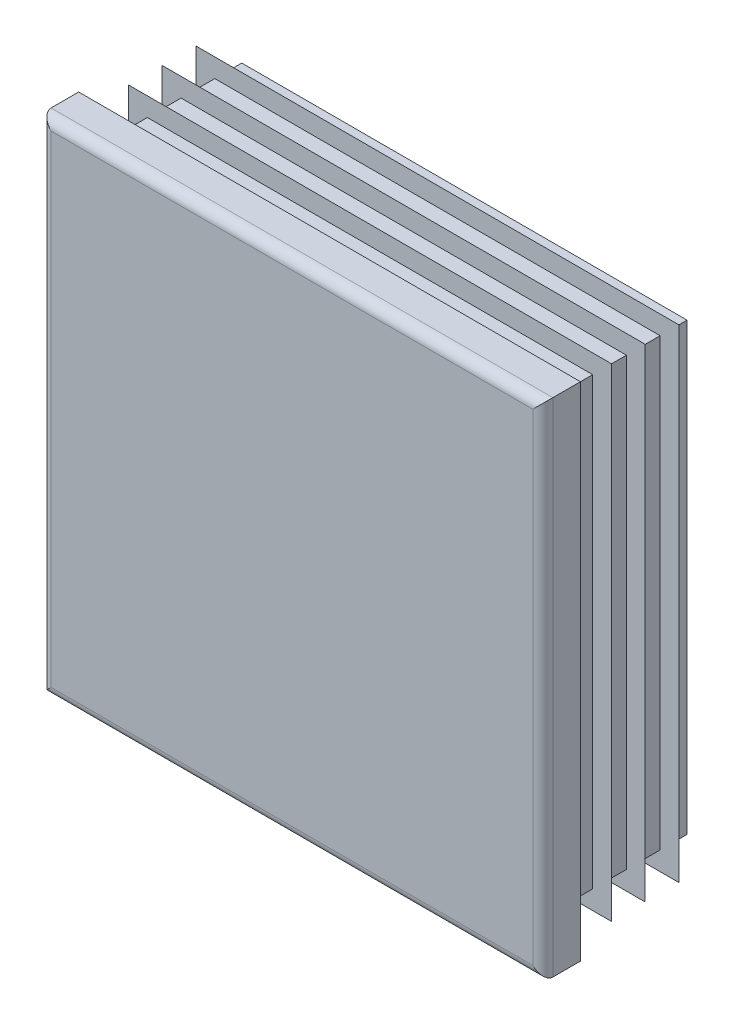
ISO-10303-21;
HEADER;
FILE_DESCRIPTION(('STEP AP214'),'2;1');
FILE_NAME('part.step','',(''),(''),'','','');
FILE_SCHEMA(('AUTOMOTIVE_DESIGN { 1 0 10303 214 1 1 1 1 }'));
ENDSEC;
DATA;
#1=APPLICATION_CONTEXT('core data for automotive mechanical design processes');
#2=APPLICATION_PROTOCOL_DEFINITION('international standard','automotive_design',2000,#1);
#3=PRODUCT_CONTEXT('',#1,'mechanical');
#4=PRODUCT('Part','Part','',(#3));
#5=PRODUCT_RELATED_PRODUCT_CATEGORY('part','',(#4));
#6=PRODUCT_DEFINITION_FORMATION('','',#4);
#7=PRODUCT_DEFINITION_CONTEXT('part definition',#1,'design');
#8=PRODUCT_DEFINITION('design','',#6,#7);
#9=PRODUCT_DEFINITION_SHAPE('','',#8);
#10=(LENGTH_UNIT() NAMED_UNIT(*) SI_UNIT(.MILLI.,.METRE.));
#11=(NAMED_UNIT(*) PLANE_ANGLE_UNIT() SI_UNIT($,.RADIAN.));
#12=(NAMED_UNIT(*) SI_UNIT($,.STERADIAN.) SOLID_ANGLE_UNIT());
#13=UNCERTAINTY_MEASURE_WITH_UNIT(LENGTH_MEASURE(1.E-05),#10,'distance_accuracy_value','');
#14=(GEOMETRIC_REPRESENTATION_CONTEXT(3) GLOBAL_UNCERTAINTY_ASSIGNED_CONTEXT((#13)) GLOBAL_UNIT_ASSIGNED_CONTEXT((#10,
#11,#12)) REPRESENTATION_CONTEXT('',''));
#15=CARTESIAN_POINT('',(0.,0.,0.));
#16=DIRECTION('',(0.,0.,1.));
#17=DIRECTION('',(1.,0.,0.));
#18=AXIS2_PLACEMENT_3D('',#15,#16,#17);
#19=CARTESIAN_POINT('',(38.4,-40.,6.));
#20=DIRECTION('',(0.,0.,-1.));
#21=DIRECTION('',(0.,1.,0.));
#22=AXIS2_PLACEMENT_3D('',#19,#20,#21);
#23=PLANE('',#22);
#24=DIRECTION('',(0.,1.,0.));
#25=VECTOR('',#24,1.);
#26=CARTESIAN_POINT('',(-38.4,-40.,6.));
#27=LINE('',#26,#25);
#28=CARTESIAN_POINT('',(-38.4,-38.4,6.));
#29=VERTEX_POINT('',#28);
#30=CARTESIAN_POINT('',(-38.4,38.4,6.));
#31=VERTEX_POINT('',#30);
#32=EDGE_CURVE('E262',#29,#31,#27,.T.);
#33=ORIENTED_EDGE('',*,*,#32,.F.);
#34=DIRECTION('',(-1.,0.,0.));
#35=VECTOR('',#34,1.);
#36=CARTESIAN_POINT('',(40.,-38.4,6.));
#37=LINE('',#36,#35);
#38=CARTESIAN_POINT('',(38.4,-38.4,6.));
#39=VERTEX_POINT('',#38);
#40=EDGE_CURVE('E432',#39,#29,#37,.T.);
#41=ORIENTED_EDGE('',*,*,#40,.F.);
#42=DIRECTION('',(0.,1.,0.));
#43=VECTOR('',#42,1.);
#44=CARTESIAN_POINT('',(38.4,-40.,6.));
#45=LINE('',#44,#43);
#46=CARTESIAN_POINT('',(38.4,38.4,6.));
#47=VERTEX_POINT('',#46);
#48=EDGE_CURVE('E257',#39,#47,#45,.T.);
#49=ORIENTED_EDGE('',*,*,#48,.T.);
#50=DIRECTION('',(-1.,0.,0.));
#51=VECTOR('',#50,1.);
#52=CARTESIAN_POINT('',(40.,38.4,6.));
#53=LINE('',#52,#51);
#54=EDGE_CURVE('E534',#47,#31,#53,.T.);
#55=ORIENTED_EDGE('',*,*,#54,.T.);
#56=EDGE_LOOP('',(#33,#41,#49,#55));
#57=FACE_BOUND('',#56,.T.);
#58=ADVANCED_FACE('F14',(#57),#23,.F.);
#59=CARTESIAN_POINT('',(-38.4,-40.,4.4));
#60=DIRECTION('',(0.,1.,0.));
#61=DIRECTION('',(-1.,0.,0.));
#62=AXIS2_PLACEMENT_3D('',#59,#60,#61);
#63=CYLINDRICAL_SURFACE('',#62,1.6);
#64=DIRECTION('',(0.,1.,0.));
#65=VECTOR('',#64,1.);
#66=CARTESIAN_POINT('',(-40.,-40.,4.4));
#67=LINE('',#66,#65);
#68=CARTESIAN_POINT('',(-40.,-40.,4.4));
#69=VERTEX_POINT('',#68);
#70=CARTESIAN_POINT('',(-40.,40.,4.4));
#71=VERTEX_POINT('',#70);
#72=EDGE_CURVE('E354',#69,#71,#67,.T.);
#73=ORIENTED_EDGE('',*,*,#72,.F.);
#74=CARTESIAN_POINT('',(-38.4,-38.4,4.4));
#75=DIRECTION('',(-0.707106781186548,0.707106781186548,0.));
#76=DIRECTION('',(0.707106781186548,0.707106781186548,0.));
#77=AXIS2_PLACEMENT_3D('',#74,#75,#76);
#78=ELLIPSE('',#77,2.26274169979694,1.6);
#79=EDGE_CURVE('E59',#69,#29,#78,.T.);
#80=ORIENTED_EDGE('',*,*,#79,.T.);
#81=ORIENTED_EDGE('',*,*,#32,.T.);
#82=CARTESIAN_POINT('',(-38.4,38.4,4.4));
#83=DIRECTION('',(0.707106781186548,0.707106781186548,0.));
#84=DIRECTION('',(-0.707106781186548,0.707106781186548,0.));
#85=AXIS2_PLACEMENT_3D('',#82,#83,#84);
#86=ELLIPSE('',#85,2.26274169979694,1.6);
#87=EDGE_CURVE('E258',#31,#71,#86,.F.);
#88=ORIENTED_EDGE('',*,*,#87,.T.);
#89=EDGE_LOOP('',(#73,#80,#81,#88));
#90=FACE_BOUND('',#89,.T.);
#91=ADVANCED_FACE('F16',(#90),#63,.T.);
#92=CARTESIAN_POINT('',(-40.,-40.,4.4));
#93=DIRECTION('',(1.,0.,0.));
#94=DIRECTION('',(0.,1.,0.));
#95=AXIS2_PLACEMENT_3D('',#92,#93,#94);
#96=PLANE('',#95);
#97=DIRECTION('',(0.,0.,-1.));
#98=VECTOR('',#97,1.);
#99=CARTESIAN_POINT('',(-40.,40.,4.4));
#100=LINE('',#99,#98);
#101=CARTESIAN_POINT('',(-40.,40.,0.));
#102=VERTEX_POINT('',#101);
#103=EDGE_CURVE('E519',#71,#102,#100,.T.);
#104=ORIENTED_EDGE('',*,*,#103,.T.);
#105=DIRECTION('',(0.,1.,0.));
#106=VECTOR('',#105,1.);
#107=CARTESIAN_POINT('',(-40.,-40.,0.));
#108=LINE('',#107,#106);
#109=CARTESIAN_POINT('',(-40.,-40.,0.));
#110=VERTEX_POINT('',#109);
#111=EDGE_CURVE('E352',#110,#102,#108,.T.);
#112=ORIENTED_EDGE('',*,*,#111,.F.);
#113=DIRECTION('',(0.,0.,-1.));
#114=VECTOR('',#113,1.);
#115=CARTESIAN_POINT('',(-40.,-40.,4.4));
#116=LINE('',#115,#114);
#117=EDGE_CURVE('E520',#69,#110,#116,.T.);
#118=ORIENTED_EDGE('',*,*,#117,.F.);
#119=ORIENTED_EDGE('',*,*,#72,.T.);
#120=EDGE_LOOP('',(#104,#112,#118,#119));
#121=FACE_BOUND('',#120,.T.);
#122=ADVANCED_FACE('F604',(#121),#96,.F.);
#123=CARTESIAN_POINT('',(-35.5,-40.,0.));
#124=DIRECTION('',(1.,0.,0.));
#125=DIRECTION('',(0.,1.,0.));
#126=AXIS2_PLACEMENT_3D('',#123,#124,#125);
#127=PLANE('',#126);
#128=DIRECTION('',(0.,1.,0.));
#129=VECTOR('',#128,1.);
#130=CARTESIAN_POINT('',(-35.5,-40.,0.));
#131=LINE('',#130,#129);
#132=CARTESIAN_POINT('',(-35.5,-35.5,0.));
#133=VERTEX_POINT('',#132);
#134=CARTESIAN_POINT('',(-35.5,35.5,0.));
#135=VERTEX_POINT('',#134);
#136=EDGE_CURVE('E349',#133,#135,#131,.T.);
#137=ORIENTED_EDGE('',*,*,#136,.T.);
#138=DIRECTION('',(0.,0.,-1.));
#139=VECTOR('',#138,1.);
#140=CARTESIAN_POINT('',(-35.5,35.5,0.));
#141=LINE('',#140,#139);
#142=CARTESIAN_POINT('',(-35.5,35.5,-1.075));
#143=VERTEX_POINT('',#142);
#144=EDGE_CURVE('E445',#135,#143,#141,.T.);
#145=ORIENTED_EDGE('',*,*,#144,.T.);
#146=DIRECTION('',(0.,1.,0.));
#147=VECTOR('',#146,1.);
#148=CARTESIAN_POINT('',(-35.5,-40.,-1.075));
#149=LINE('',#148,#147);
#150=CARTESIAN_POINT('',(-35.5,-35.5,-1.075));
#151=VERTEX_POINT('',#150);
#152=EDGE_CURVE('E346',#151,#143,#149,.T.);
#153=ORIENTED_EDGE('',*,*,#152,.F.);
#154=DIRECTION('',(0.,0.,1.));
#155=VECTOR('',#154,1.);
#156=CARTESIAN_POINT('',(-35.5,-35.5,0.));
#157=LINE('',#156,#155);
#158=EDGE_CURVE('E439',#151,#133,#157,.T.);
#159=ORIENTED_EDGE('',*,*,#158,.T.);
#160=EDGE_LOOP('',(#137,#145,#153,#159));
#161=FACE_BOUND('',#160,.T.);
#162=ADVANCED_FACE('F728',(#161),#127,.F.);
#163=CARTESIAN_POINT('',(-38.5,-40.,-1.075));
#164=DIRECTION('',(0.573576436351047,0.,0.819152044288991));
#165=DIRECTION('',(-0.819152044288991,0.,0.573576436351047));
#166=AXIS2_PLACEMENT_3D('',#163,#164,#165);
#167=PLANE('',#166);
#168=DIRECTION('',(0.,1.,0.));
#169=VECTOR('',#168,1.);
#170=CARTESIAN_POINT('',(-38.5,-40.,-1.075));
#171=LINE('',#170,#169);
#172=CARTESIAN_POINT('',(-38.5,-38.5,-1.075));
#173=VERTEX_POINT('',#172);
#174=CARTESIAN_POINT('',(-38.5,38.5,-1.075));
#175=VERTEX_POINT('',#174);
#176=EDGE_CURVE('E344',#173,#175,#171,.T.);
#177=ORIENTED_EDGE('',*,*,#176,.T.);
#178=DIRECTION('',(0.633687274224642,-0.633687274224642,-0.443712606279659));
#179=VECTOR('',#178,1.);
#180=CARTESIAN_POINT('',(-6.97757442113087,6.97757442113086,-23.1472400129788));
#181=LINE('',#180,#179);
#182=CARTESIAN_POINT('',(-35.5,35.5,-3.17562261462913));
#183=VERTEX_POINT('',#182);
#184=EDGE_CURVE('E457',#175,#183,#181,.T.);
#185=ORIENTED_EDGE('',*,*,#184,.T.);
#186=DIRECTION('',(0.,1.,0.));
#187=VECTOR('',#186,1.);
#188=CARTESIAN_POINT('',(-35.5,-40.,-3.17562261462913));
#189=LINE('',#188,#187);
#190=CARTESIAN_POINT('',(-35.5,-35.5,-3.17562261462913));
#191=VERTEX_POINT('',#190);
#192=EDGE_CURVE('E341',#191,#183,#189,.T.);
#193=ORIENTED_EDGE('',*,*,#192,.F.);
#194=DIRECTION('',(-0.633687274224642,-0.633687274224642,0.443712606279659));
#195=VECTOR('',#194,1.);
#196=CARTESIAN_POINT('',(-39.1023393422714,-39.1023393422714,-0.653237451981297));
#197=LINE('',#196,#195);
#198=EDGE_CURVE('E451',#191,#173,#197,.T.);
#199=ORIENTED_EDGE('',*,*,#198,.T.);
#200=EDGE_LOOP('',(#177,#185,#193,#199));
#201=FACE_BOUND('',#200,.T.);
#202=ADVANCED_FACE('F732',(#201),#167,.F.);
#203=CARTESIAN_POINT('',(-35.5,-40.,-3.17562261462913));
#204=DIRECTION('',(1.,0.,0.));
#205=DIRECTION('',(0.,1.,0.));
#206=AXIS2_PLACEMENT_3D('',#203,#204,#205);
#207=PLANE('',#206);
#208=ORIENTED_EDGE('',*,*,#192,.T.);
#209=DIRECTION('',(0.,0.,-1.));
#210=VECTOR('',#209,1.);
#211=CARTESIAN_POINT('',(-35.5,35.5,-3.17562261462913));
#212=LINE('',#211,#210);
#213=CARTESIAN_POINT('',(-35.5,35.5,-6.45));
#214=VERTEX_POINT('',#213);
#215=EDGE_CURVE('E463',#183,#214,#212,.T.);
#216=ORIENTED_EDGE('',*,*,#215,.T.);
#217=DIRECTION('',(0.,1.,0.));
#218=VECTOR('',#217,1.);
#219=CARTESIAN_POINT('',(-35.5,-40.,-6.45));
#220=LINE('',#219,#218);
#221=CARTESIAN_POINT('',(-35.5,-35.5,-6.45));
#222=VERTEX_POINT('',#221);
#223=EDGE_CURVE('E338',#222,#214,#220,.T.);
#224=ORIENTED_EDGE('',*,*,#223,.F.);
#225=DIRECTION('',(0.,0.,1.));
#226=VECTOR('',#225,1.);
#227=CARTESIAN_POINT('',(-35.5,-35.5,-3.17562261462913));
#228=LINE('',#227,#226);
#229=EDGE_CURVE('E460',#222,#191,#228,.T.);
#230=ORIENTED_EDGE('',*,*,#229,.T.);
#231=EDGE_LOOP('',(#208,#216,#224,#230));
#232=FACE_BOUND('',#231,.T.);
#233=ADVANCED_FACE('F738',(#232),#207,.F.);
#234=CARTESIAN_POINT('',(-38.5,-40.,-6.45));
#235=DIRECTION('',(0.573576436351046,0.,0.819152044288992));
#236=DIRECTION('',(-0.819152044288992,0.,0.573576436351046));
#237=AXIS2_PLACEMENT_3D('',#234,#235,#236);
#238=PLANE('',#237);
#239=DIRECTION('',(0.,1.,0.));
#240=VECTOR('',#239,1.);
#241=CARTESIAN_POINT('',(-38.5,-40.,-6.45));
#242=LINE('',#241,#240);
#243=CARTESIAN_POINT('',(-38.5,-38.5,-6.45));
#244=VERTEX_POINT('',#243);
#245=CARTESIAN_POINT('',(-38.5,38.5,-6.45));
#246=VERTEX_POINT('',#245);
#247=EDGE_CURVE('E336',#244,#246,#242,.T.);
#248=ORIENTED_EDGE('',*,*,#247,.T.);
#249=DIRECTION('',(0.633687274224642,-0.633687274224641,-0.443712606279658));
#250=VECTOR('',#249,1.);
#251=CARTESIAN_POINT('',(-6.97757442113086,6.97757442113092,-28.5222400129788));
#252=LINE('',#251,#250);
#253=CARTESIAN_POINT('',(-35.5,35.5,-8.55062261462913));
#254=VERTEX_POINT('',#253);
#255=EDGE_CURVE('E475',#246,#254,#252,.T.);
#256=ORIENTED_EDGE('',*,*,#255,.T.);
#257=DIRECTION('',(0.,1.,0.));
#258=VECTOR('',#257,1.);
#259=CARTESIAN_POINT('',(-35.5,-40.,-8.55062261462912));
#260=LINE('',#259,#258);
#261=CARTESIAN_POINT('',(-35.5,-35.5,-8.55062261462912));
#262=VERTEX_POINT('',#261);
#263=EDGE_CURVE('E333',#262,#254,#260,.T.);
#264=ORIENTED_EDGE('',*,*,#263,.F.);
#265=DIRECTION('',(-0.633687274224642,-0.633687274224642,0.443712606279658));
#266=VECTOR('',#265,1.);
#267=CARTESIAN_POINT('',(-39.1023393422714,-39.1023393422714,-6.0282374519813));
#268=LINE('',#267,#266);
#269=EDGE_CURVE('E469',#262,#244,#268,.T.);
#270=ORIENTED_EDGE('',*,*,#269,.T.);
#271=EDGE_LOOP('',(#248,#256,#264,#270));
#272=FACE_BOUND('',#271,.T.);
#273=ADVANCED_FACE('F742',(#272),#238,.F.);
#274=CARTESIAN_POINT('',(-35.5,-40.,-8.55062261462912));
#275=DIRECTION('',(1.,0.,0.));
#276=DIRECTION('',(0.,1.,0.));
#277=AXIS2_PLACEMENT_3D('',#274,#275,#276);
#278=PLANE('',#277);
#279=ORIENTED_EDGE('',*,*,#263,.T.);
#280=DIRECTION('',(0.,0.,-1.));
#281=VECTOR('',#280,1.);
#282=CARTESIAN_POINT('',(-35.5,35.5,-8.55062261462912));
#283=LINE('',#282,#281);
#284=CARTESIAN_POINT('',(-35.5,35.5,-11.825));
#285=VERTEX_POINT('',#284);
#286=EDGE_CURVE('E481',#254,#285,#283,.T.);
#287=ORIENTED_EDGE('',*,*,#286,.T.);
#288=DIRECTION('',(0.,1.,0.));
#289=VECTOR('',#288,1.);
#290=CARTESIAN_POINT('',(-35.5,-40.,-11.825));
#291=LINE('',#290,#289);
#292=CARTESIAN_POINT('',(-35.5,-35.5,-11.825));
#293=VERTEX_POINT('',#292);
#294=EDGE_CURVE('E330',#293,#285,#291,.T.);
#295=ORIENTED_EDGE('',*,*,#294,.F.);
#296=DIRECTION('',(0.,0.,1.));
#297=VECTOR('',#296,1.);
#298=CARTESIAN_POINT('',(-35.5,-35.5,-8.55062261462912));
#299=LINE('',#298,#297);
#300=EDGE_CURVE('E478',#293,#262,#299,.T.);
#301=ORIENTED_EDGE('',*,*,#300,.T.);
#302=EDGE_LOOP('',(#279,#287,#295,#301));
#303=FACE_BOUND('',#302,.T.);
#304=ADVANCED_FACE('F746',(#303),#278,.F.);
#305=CARTESIAN_POINT('',(-38.5,-40.,-11.825));
#306=DIRECTION('',(0.573576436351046,0.,0.819152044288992));
#307=DIRECTION('',(-0.819152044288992,0.,0.573576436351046));
#308=AXIS2_PLACEMENT_3D('',#305,#306,#307);
#309=PLANE('',#308);
#310=DIRECTION('',(0.,1.,0.));
#311=VECTOR('',#310,1.);
#312=CARTESIAN_POINT('',(-38.5,-40.,-11.825));
#313=LINE('',#312,#311);
#314=CARTESIAN_POINT('',(-38.5,-38.5,-11.825));
#315=VERTEX_POINT('',#314);
#316=CARTESIAN_POINT('',(-38.5,38.5,-11.825));
#317=VERTEX_POINT('',#316);
#318=EDGE_CURVE('E328',#315,#317,#313,.T.);
#319=ORIENTED_EDGE('',*,*,#318,.T.);
#320=DIRECTION('',(0.633687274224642,-0.633687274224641,-0.443712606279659));
#321=VECTOR('',#320,1.);
#322=CARTESIAN_POINT('',(-6.97757442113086,6.97757442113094,-33.8972400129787));
#323=LINE('',#322,#321);
#324=CARTESIAN_POINT('',(-35.5,35.5,-13.9256226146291));
#325=VERTEX_POINT('',#324);
#326=EDGE_CURVE('E493',#317,#325,#323,.T.);
#327=ORIENTED_EDGE('',*,*,#326,.T.);
#328=DIRECTION('',(0.,1.,0.));
#329=VECTOR('',#328,1.);
#330=CARTESIAN_POINT('',(-35.5,-40.,-13.9256226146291));
#331=LINE('',#330,#329);
#332=CARTESIAN_POINT('',(-35.5,-35.5,-13.9256226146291));
#333=VERTEX_POINT('',#332);
#334=EDGE_CURVE('E325',#333,#325,#331,.T.);
#335=ORIENTED_EDGE('',*,*,#334,.F.);
#336=DIRECTION('',(-0.633687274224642,-0.633687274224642,0.443712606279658));
#337=VECTOR('',#336,1.);
#338=CARTESIAN_POINT('',(-39.1023393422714,-39.1023393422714,-11.4032374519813));
#339=LINE('',#338,#337);
#340=EDGE_CURVE('E487',#333,#315,#339,.T.);
#341=ORIENTED_EDGE('',*,*,#340,.T.);
#342=EDGE_LOOP('',(#319,#327,#335,#341));
#343=FACE_BOUND('',#342,.T.);
#344=ADVANCED_FACE('F668',(#343),#309,.F.);
#345=CARTESIAN_POINT('',(-35.5,-40.,-13.9256226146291));
#346=DIRECTION('',(1.,0.,0.));
#347=DIRECTION('',(0.,1.,0.));
#348=AXIS2_PLACEMENT_3D('',#345,#346,#347);
#349=PLANE('',#348);
#350=ORIENTED_EDGE('',*,*,#334,.T.);
#351=DIRECTION('',(0.,0.,-1.));
#352=VECTOR('',#351,1.);
#353=CARTESIAN_POINT('',(-35.5,35.5,-13.9256226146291));
#354=LINE('',#353,#352);
#355=CARTESIAN_POINT('',(-35.5,35.5,-17.2));
#356=VERTEX_POINT('',#355);
#357=EDGE_CURVE('E499',#325,#356,#354,.T.);
#358=ORIENTED_EDGE('',*,*,#357,.T.);
#359=DIRECTION('',(0.,1.,0.));
#360=VECTOR('',#359,1.);
#361=CARTESIAN_POINT('',(-35.5,-40.,-17.2));
#362=LINE('',#361,#360);
#363=CARTESIAN_POINT('',(-35.5,-35.5,-17.2));
#364=VERTEX_POINT('',#363);
#365=EDGE_CURVE('E322',#364,#356,#362,.T.);
#366=ORIENTED_EDGE('',*,*,#365,.F.);
#367=DIRECTION('',(0.,0.,1.));
#368=VECTOR('',#367,1.);
#369=CARTESIAN_POINT('',(-35.5,-35.5,-13.9256226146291));
#370=LINE('',#369,#368);
#371=EDGE_CURVE('E496',#364,#333,#370,.T.);
#372=ORIENTED_EDGE('',*,*,#371,.T.);
#373=EDGE_LOOP('',(#350,#358,#366,#372));
#374=FACE_BOUND('',#373,.T.);
#375=ADVANCED_FACE('F665',(#374),#349,.F.);
#376=CARTESIAN_POINT('',(-38.5,-40.,-17.2));
#377=DIRECTION('',(0.573576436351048,0.,0.819152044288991));
#378=DIRECTION('',(-0.819152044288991,0.,0.573576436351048));
#379=AXIS2_PLACEMENT_3D('',#376,#377,#378);
#380=PLANE('',#379);
#381=DIRECTION('',(0.,1.,0.));
#382=VECTOR('',#381,1.);
#383=CARTESIAN_POINT('',(-38.5,-40.,-17.2));
#384=LINE('',#383,#382);
#385=CARTESIAN_POINT('',(-38.5,-38.5,-17.2));
#386=VERTEX_POINT('',#385);
#387=CARTESIAN_POINT('',(-38.5,38.5,-17.2));
#388=VERTEX_POINT('',#387);
#389=EDGE_CURVE('E320',#386,#388,#384,.T.);
#390=ORIENTED_EDGE('',*,*,#389,.T.);
#391=DIRECTION('',(0.633687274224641,-0.633687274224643,-0.443712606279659));
#392=VECTOR('',#391,1.);
#393=CARTESIAN_POINT('',(-6.97757442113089,6.97757442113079,-39.2722400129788));
#394=LINE('',#393,#392);
#395=CARTESIAN_POINT('',(-35.5,35.5,-19.3006226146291));
#396=VERTEX_POINT('',#395);
#397=EDGE_CURVE('E511',#388,#396,#394,.T.);
#398=ORIENTED_EDGE('',*,*,#397,.T.);
#399=DIRECTION('',(0.,1.,0.));
#400=VECTOR('',#399,1.);
#401=CARTESIAN_POINT('',(-35.5,-40.,-19.3006226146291));
#402=LINE('',#401,#400);
#403=CARTESIAN_POINT('',(-35.5,-35.5,-19.3006226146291));
#404=VERTEX_POINT('',#403);
#405=EDGE_CURVE('E317',#404,#396,#402,.T.);
#406=ORIENTED_EDGE('',*,*,#405,.F.);
#407=DIRECTION('',(-0.633687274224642,-0.633687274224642,0.44371260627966));
#408=VECTOR('',#407,1.);
#409=CARTESIAN_POINT('',(-39.1023393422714,-39.1023393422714,-16.7782374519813));
#410=LINE('',#409,#408);
#411=EDGE_CURVE('E505',#404,#386,#410,.T.);
#412=ORIENTED_EDGE('',*,*,#411,.T.);
#413=EDGE_LOOP('',(#390,#398,#406,#412));
#414=FACE_BOUND('',#413,.T.);
#415=ADVANCED_FACE('F580',(#414),#380,.F.);
#416=CARTESIAN_POINT('',(-35.5,-40.,-19.3006226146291));
#417=DIRECTION('',(1.,0.,0.));
#418=DIRECTION('',(0.,1.,0.));
#419=AXIS2_PLACEMENT_3D('',#416,#417,#418);
#420=PLANE('',#419);
#421=ORIENTED_EDGE('',*,*,#405,.T.);
#422=DIRECTION('',(0.,0.,-1.));
#423=VECTOR('',#422,1.);
#424=CARTESIAN_POINT('',(-35.5,35.5,-19.3006226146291));
#425=LINE('',#424,#423);
#426=CARTESIAN_POINT('',(-35.5,35.5,-21.5));
#427=VERTEX_POINT('',#426);
#428=EDGE_CURVE('E517',#396,#427,#425,.T.);
#429=ORIENTED_EDGE('',*,*,#428,.T.);
#430=DIRECTION('',(0.,1.,0.));
#431=VECTOR('',#430,1.);
#432=CARTESIAN_POINT('',(-35.5,-40.,-21.5));
#433=LINE('',#432,#431);
#434=CARTESIAN_POINT('',(-35.5,-35.5,-21.5));
#435=VERTEX_POINT('',#434);
#436=EDGE_CURVE('E314',#435,#427,#433,.T.);
#437=ORIENTED_EDGE('',*,*,#436,.F.);
#438=DIRECTION('',(0.,0.,1.));
#439=VECTOR('',#438,1.);
#440=CARTESIAN_POINT('',(-35.5,-35.5,-19.3006226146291));
#441=LINE('',#440,#439);
#442=EDGE_CURVE('E514',#435,#404,#441,.T.);
#443=ORIENTED_EDGE('',*,*,#442,.T.);
#444=EDGE_LOOP('',(#421,#429,#437,#443));
#445=FACE_BOUND('',#444,.T.);
#446=ADVANCED_FACE('F582',(#445),#420,.F.);
#447=CARTESIAN_POINT('',(-35.5,-40.,-21.5));
#448=DIRECTION('',(0.,0.,1.));
#449=DIRECTION('',(0.,-1.,0.));
#450=AXIS2_PLACEMENT_3D('',#447,#448,#449);
#451=PLANE('',#450);
#452=ORIENTED_EDGE('',*,*,#436,.T.);
#453=DIRECTION('',(-1.,0.,0.));
#454=VECTOR('',#453,1.);
#455=CARTESIAN_POINT('',(40.,35.5,-21.5));
#456=LINE('',#455,#454);
#457=CARTESIAN_POINT('',(35.5,35.5,-21.5));
#458=VERTEX_POINT('',#457);
#459=EDGE_CURVE('E388',#458,#427,#456,.T.);
#460=ORIENTED_EDGE('',*,*,#459,.F.);
#461=DIRECTION('',(0.,1.,0.));
#462=VECTOR('',#461,1.);
#463=CARTESIAN_POINT('',(35.5,-40.,-21.5));
#464=LINE('',#463,#462);
#465=CARTESIAN_POINT('',(35.5,-35.5,-21.5));
#466=VERTEX_POINT('',#465);
#467=EDGE_CURVE('E311',#466,#458,#464,.T.);
#468=ORIENTED_EDGE('',*,*,#467,.F.);
#469=DIRECTION('',(-1.,0.,0.));
#470=VECTOR('',#469,1.);
#471=CARTESIAN_POINT('',(40.,-35.5,-21.5));
#472=LINE('',#471,#470);
#473=EDGE_CURVE('E386',#466,#435,#472,.T.);
#474=ORIENTED_EDGE('',*,*,#473,.T.);
#475=EDGE_LOOP('',(#452,#460,#468,#474));
#476=FACE_BOUND('',#475,.T.);
#477=ADVANCED_FACE('F385',(#476),#451,.F.);
#478=CARTESIAN_POINT('',(35.5,-40.,-21.5));
#479=DIRECTION('',(-1.,0.,0.));
#480=DIRECTION('',(0.,-1.,0.));
#481=AXIS2_PLACEMENT_3D('',#478,#479,#480);
#482=PLANE('',#481);
#483=ORIENTED_EDGE('',*,*,#467,.T.);
#484=DIRECTION('',(0.,0.,1.));
#485=VECTOR('',#484,1.);
#486=CARTESIAN_POINT('',(35.5,35.5,-21.5));
#487=LINE('',#486,#485);
#488=CARTESIAN_POINT('',(35.5,35.5,-19.3006226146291));
#489=VERTEX_POINT('',#488);
#490=EDGE_CURVE('E9',#458,#489,#487,.T.);
#491=ORIENTED_EDGE('',*,*,#490,.T.);
#492=DIRECTION('',(0.,1.,0.));
#493=VECTOR('',#492,1.);
#494=CARTESIAN_POINT('',(35.5,-40.,-19.3006226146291));
#495=LINE('',#494,#493);
#496=CARTESIAN_POINT('',(35.5,-35.5,-19.3006226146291));
#497=VERTEX_POINT('',#496);
#498=EDGE_CURVE('E308',#497,#489,#495,.T.);
#499=ORIENTED_EDGE('',*,*,#498,.F.);
#500=DIRECTION('',(0.,0.,-1.));
#501=VECTOR('',#500,1.);
#502=CARTESIAN_POINT('',(35.5,-35.5,-21.5));
#503=LINE('',#502,#501);
#504=EDGE_CURVE('E23',#497,#466,#503,.T.);
#505=ORIENTED_EDGE('',*,*,#504,.T.);
#506=EDGE_LOOP('',(#483,#491,#499,#505));
#507=FACE_BOUND('',#506,.T.);
#508=ADVANCED_FACE('F378',(#507),#482,.F.);
#509=CARTESIAN_POINT('',(35.5,-40.,-19.3006226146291));
#510=DIRECTION('',(-0.573576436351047,0.,0.819152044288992));
#511=DIRECTION('',(-0.819152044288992,0.,-0.573576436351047));
#512=AXIS2_PLACEMENT_3D('',#509,#510,#511);
#513=PLANE('',#512);
#514=ORIENTED_EDGE('',*,*,#498,.T.);
#515=DIRECTION('',(0.633687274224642,0.633687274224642,0.443712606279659));
#516=VECTOR('',#515,1.);
#517=CARTESIAN_POINT('',(5.18225310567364,5.18225310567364,-40.5293375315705));
#518=LINE('',#517,#516);
#519=CARTESIAN_POINT('',(38.5,38.5,-17.2));
#520=VERTEX_POINT('',#519);
#521=EDGE_CURVE('E508',#489,#520,#518,.T.);
#522=ORIENTED_EDGE('',*,*,#521,.T.);
#523=DIRECTION('',(0.,1.,0.));
#524=VECTOR('',#523,1.);
#525=CARTESIAN_POINT('',(38.5,-40.,-17.2));
#526=LINE('',#525,#524);
#527=CARTESIAN_POINT('',(38.5,-38.5,-17.2));
#528=VERTEX_POINT('',#527);
#529=EDGE_CURVE('E305',#528,#520,#526,.T.);
#530=ORIENTED_EDGE('',*,*,#529,.F.);
#531=DIRECTION('',(-0.633687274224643,0.633687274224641,-0.443712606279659));
#532=VECTOR('',#531,1.);
#533=CARTESIAN_POINT('',(37.3070180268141,-37.3070180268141,-18.0353349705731));
#534=LINE('',#533,#532);
#535=EDGE_CURVE('E502',#528,#497,#534,.T.);
#536=ORIENTED_EDGE('',*,*,#535,.T.);
#537=EDGE_LOOP('',(#514,#522,#530,#536));
#538=FACE_BOUND('',#537,.T.);
#539=ADVANCED_FACE('F588',(#538),#513,.F.);
#540=CARTESIAN_POINT('',(38.5,-40.,-17.2));
#541=DIRECTION('',(0.,0.,-1.));
#542=DIRECTION('',(0.,1.,0.));
#543=AXIS2_PLACEMENT_3D('',#540,#541,#542);
#544=PLANE('',#543);
#545=ORIENTED_EDGE('',*,*,#529,.T.);
#546=DIRECTION('',(-1.,0.,0.));
#547=VECTOR('',#546,1.);
#548=CARTESIAN_POINT('',(40.,38.5,-17.2));
#549=LINE('',#548,#547);
#550=EDGE_CURVE('E394',#520,#388,#549,.T.);
#551=ORIENTED_EDGE('',*,*,#550,.T.);
#552=ORIENTED_EDGE('',*,*,#389,.F.);
#553=DIRECTION('',(-1.,0.,0.));
#554=VECTOR('',#553,1.);
#555=CARTESIAN_POINT('',(40.,-38.5,-17.2));
#556=LINE('',#555,#554);
#557=EDGE_CURVE('E401',#528,#386,#556,.T.);
#558=ORIENTED_EDGE('',*,*,#557,.F.);
#559=EDGE_LOOP('',(#545,#551,#552,#558));
#560=FACE_BOUND('',#559,.T.);
#561=ORIENTED_EDGE('',*,*,#365,.T.);
#562=DIRECTION('',(-1.,0.,0.));
#563=VECTOR('',#562,1.);
#564=CARTESIAN_POINT('',(40.,35.5,-17.2));
#565=LINE('',#564,#563);
#566=CARTESIAN_POINT('',(35.5,35.5,-17.2));
#567=VERTEX_POINT('',#566);
#568=EDGE_CURVE('E567',#567,#356,#565,.T.);
#569=ORIENTED_EDGE('',*,*,#568,.F.);
#570=DIRECTION('',(0.,1.,0.));
#571=VECTOR('',#570,1.);
#572=CARTESIAN_POINT('',(35.5,-40.,-17.2));
#573=LINE('',#572,#571);
#574=CARTESIAN_POINT('',(35.5,-35.5,-17.2));
#575=VERTEX_POINT('',#574);
#576=EDGE_CURVE('E302',#575,#567,#573,.T.);
#577=ORIENTED_EDGE('',*,*,#576,.F.);
#578=DIRECTION('',(-1.,0.,0.));
#579=VECTOR('',#578,1.);
#580=CARTESIAN_POINT('',(40.,-35.5,-17.2));
#581=LINE('',#580,#579);
#582=EDGE_CURVE('E403',#575,#364,#581,.T.);
#583=ORIENTED_EDGE('',*,*,#582,.T.);
#584=EDGE_LOOP('',(#561,#569,#577,#583));
#585=FACE_BOUND('',#584,.T.);
#586=ADVANCED_FACE('F571',(#560,#585),#544,.F.);
#587=CARTESIAN_POINT('',(35.5,-40.,-17.2));
#588=DIRECTION('',(-1.,0.,0.));
#589=DIRECTION('',(0.,-1.,0.));
#590=AXIS2_PLACEMENT_3D('',#587,#588,#589);
#591=PLANE('',#590);
#592=ORIENTED_EDGE('',*,*,#576,.T.);
#593=DIRECTION('',(0.,0.,1.));
#594=VECTOR('',#593,1.);
#595=CARTESIAN_POINT('',(35.5,35.5,-17.2));
#596=LINE('',#595,#594);
#597=CARTESIAN_POINT('',(35.5,35.5,-13.9256226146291));
#598=VERTEX_POINT('',#597);
#599=EDGE_CURVE('E372',#567,#598,#596,.T.);
#600=ORIENTED_EDGE('',*,*,#599,.T.);
#601=DIRECTION('',(0.,1.,0.));
#602=VECTOR('',#601,1.);
#603=CARTESIAN_POINT('',(35.5,-40.,-13.9256226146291));
#604=LINE('',#603,#602);
#605=CARTESIAN_POINT('',(35.5,-35.5,-13.9256226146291));
#606=VERTEX_POINT('',#605);
#607=EDGE_CURVE('E299',#606,#598,#604,.T.);
#608=ORIENTED_EDGE('',*,*,#607,.F.);
#609=DIRECTION('',(0.,0.,-1.));
#610=VECTOR('',#609,1.);
#611=CARTESIAN_POINT('',(35.5,-35.5,-17.2));
#612=LINE('',#611,#610);
#613=EDGE_CURVE('E369',#606,#575,#612,.T.);
#614=ORIENTED_EDGE('',*,*,#613,.T.);
#615=EDGE_LOOP('',(#592,#600,#608,#614));
#616=FACE_BOUND('',#615,.T.);
#617=ADVANCED_FACE('F596',(#616),#591,.F.);
#618=CARTESIAN_POINT('',(35.5,-40.,-13.9256226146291));
#619=DIRECTION('',(-0.573576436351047,0.,0.819152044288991));
#620=DIRECTION('',(-0.819152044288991,0.,-0.573576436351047));
#621=AXIS2_PLACEMENT_3D('',#618,#619,#620);
#622=PLANE('',#621);
#623=ORIENTED_EDGE('',*,*,#607,.T.);
#624=DIRECTION('',(0.633687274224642,0.633687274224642,0.443712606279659));
#625=VECTOR('',#624,1.);
#626=CARTESIAN_POINT('',(5.18225310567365,5.18225310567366,-35.1543375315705));
#627=LINE('',#626,#625);
#628=CARTESIAN_POINT('',(38.5,38.5,-11.825));
#629=VERTEX_POINT('',#628);
#630=EDGE_CURVE('E490',#598,#629,#627,.T.);
#631=ORIENTED_EDGE('',*,*,#630,.T.);
#632=DIRECTION('',(0.,1.,0.));
#633=VECTOR('',#632,1.);
#634=CARTESIAN_POINT('',(38.5,-40.,-11.825));
#635=LINE('',#634,#633);
#636=CARTESIAN_POINT('',(38.5,-38.5,-11.825));
#637=VERTEX_POINT('',#636);
#638=EDGE_CURVE('E296',#637,#629,#635,.T.);
#639=ORIENTED_EDGE('',*,*,#638,.F.);
#640=DIRECTION('',(-0.633687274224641,0.633687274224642,-0.443712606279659));
#641=VECTOR('',#640,1.);
#642=CARTESIAN_POINT('',(37.3070180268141,-37.3070180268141,-12.660334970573));
#643=LINE('',#642,#641);
#644=EDGE_CURVE('E484',#637,#606,#643,.T.);
#645=ORIENTED_EDGE('',*,*,#644,.T.);
#646=EDGE_LOOP('',(#623,#631,#639,#645));
#647=FACE_BOUND('',#646,.T.);
#648=ADVANCED_FACE('F648',(#647),#622,.F.);
#649=CARTESIAN_POINT('',(38.5,-40.,-11.825));
#650=DIRECTION('',(0.,0.,-1.));
#651=DIRECTION('',(0.,1.,0.));
#652=AXIS2_PLACEMENT_3D('',#649,#650,#651);
#653=PLANE('',#652);
#654=ORIENTED_EDGE('',*,*,#638,.T.);
#655=DIRECTION('',(-1.,0.,0.));
#656=VECTOR('',#655,1.);
#657=CARTESIAN_POINT('',(40.,38.5,-11.825));
#658=LINE('',#657,#656);
#659=EDGE_CURVE('E561',#629,#317,#658,.T.);
#660=ORIENTED_EDGE('',*,*,#659,.T.);
#661=ORIENTED_EDGE('',*,*,#318,.F.);
#662=DIRECTION('',(-1.,0.,0.));
#663=VECTOR('',#662,1.);
#664=CARTESIAN_POINT('',(40.,-38.5,-11.825));
#665=LINE('',#664,#663);
#666=EDGE_CURVE('E409',#637,#315,#665,.T.);
#667=ORIENTED_EDGE('',*,*,#666,.F.);
#668=EDGE_LOOP('',(#654,#660,#661,#667));
#669=FACE_BOUND('',#668,.T.);
#670=ORIENTED_EDGE('',*,*,#294,.T.);
#671=DIRECTION('',(-1.,0.,0.));
#672=VECTOR('',#671,1.);
#673=CARTESIAN_POINT('',(40.,35.5,-11.825));
#674=LINE('',#673,#672);
#675=CARTESIAN_POINT('',(35.5,35.5,-11.825));
#676=VERTEX_POINT('',#675);
#677=EDGE_CURVE('E559',#676,#285,#674,.T.);
#678=ORIENTED_EDGE('',*,*,#677,.F.);
#679=DIRECTION('',(0.,1.,0.));
#680=VECTOR('',#679,1.);
#681=CARTESIAN_POINT('',(35.5,-40.,-11.825));
#682=LINE('',#681,#680);
#683=CARTESIAN_POINT('',(35.5,-35.5,-11.825));
#684=VERTEX_POINT('',#683);
#685=EDGE_CURVE('E293',#684,#676,#682,.T.);
#686=ORIENTED_EDGE('',*,*,#685,.F.);
#687=DIRECTION('',(-1.,0.,0.));
#688=VECTOR('',#687,1.);
#689=CARTESIAN_POINT('',(40.,-35.5,-11.825));
#690=LINE('',#689,#688);
#691=EDGE_CURVE('E411',#684,#293,#690,.T.);
#692=ORIENTED_EDGE('',*,*,#691,.T.);
#693=EDGE_LOOP('',(#670,#678,#686,#692));
#694=FACE_BOUND('',#693,.T.);
#695=ADVANCED_FACE('F644',(#669,#694),#653,.F.);
#696=CARTESIAN_POINT('',(35.5,-40.,-11.825));
#697=DIRECTION('',(-1.,0.,0.));
#698=DIRECTION('',(0.,-1.,0.));
#699=AXIS2_PLACEMENT_3D('',#696,#697,#698);
#700=PLANE('',#699);
#701=ORIENTED_EDGE('',*,*,#685,.T.);
#702=DIRECTION('',(0.,0.,1.));
#703=VECTOR('',#702,1.);
#704=CARTESIAN_POINT('',(35.5,35.5,-11.825));
#705=LINE('',#704,#703);
#706=CARTESIAN_POINT('',(35.5,35.5,-8.55062261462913));
#707=VERTEX_POINT('',#706);
#708=EDGE_CURVE('E366',#676,#707,#705,.T.);
#709=ORIENTED_EDGE('',*,*,#708,.T.);
#710=DIRECTION('',(0.,1.,0.));
#711=VECTOR('',#710,1.);
#712=CARTESIAN_POINT('',(35.5,-40.,-8.55062261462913));
#713=LINE('',#712,#711);
#714=CARTESIAN_POINT('',(35.5,-35.5,-8.55062261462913));
#715=VERTEX_POINT('',#714);
#716=EDGE_CURVE('E290',#715,#707,#713,.T.);
#717=ORIENTED_EDGE('',*,*,#716,.F.);
#718=DIRECTION('',(0.,0.,-1.));
#719=VECTOR('',#718,1.);
#720=CARTESIAN_POINT('',(35.5,-35.5,-11.825));
#721=LINE('',#720,#719);
#722=EDGE_CURVE('E363',#715,#684,#721,.T.);
#723=ORIENTED_EDGE('',*,*,#722,.T.);
#724=EDGE_LOOP('',(#701,#709,#717,#723));
#725=FACE_BOUND('',#724,.T.);
#726=ADVANCED_FACE('F640',(#725),#700,.F.);
#727=CARTESIAN_POINT('',(35.5,-40.,-8.55062261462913));
#728=DIRECTION('',(-0.573576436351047,0.,0.819152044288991));
#729=DIRECTION('',(-0.819152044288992,0.,-0.573576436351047));
#730=AXIS2_PLACEMENT_3D('',#727,#728,#729);
#731=PLANE('',#730);
#732=ORIENTED_EDGE('',*,*,#716,.T.);
#733=DIRECTION('',(0.633687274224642,0.633687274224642,0.443712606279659));
#734=VECTOR('',#733,1.);
#735=CARTESIAN_POINT('',(5.18225310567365,5.18225310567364,-29.7793375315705));
#736=LINE('',#735,#734);
#737=CARTESIAN_POINT('',(38.5,38.5,-6.45));
#738=VERTEX_POINT('',#737);
#739=EDGE_CURVE('E472',#707,#738,#736,.T.);
#740=ORIENTED_EDGE('',*,*,#739,.T.);
#741=DIRECTION('',(0.,1.,0.));
#742=VECTOR('',#741,1.);
#743=CARTESIAN_POINT('',(38.5,-40.,-6.45));
#744=LINE('',#743,#742);
#745=CARTESIAN_POINT('',(38.5,-38.5,-6.45));
#746=VERTEX_POINT('',#745);
#747=EDGE_CURVE('E287',#746,#738,#744,.T.);
#748=ORIENTED_EDGE('',*,*,#747,.F.);
#749=DIRECTION('',(-0.633687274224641,0.633687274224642,-0.443712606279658));
#750=VECTOR('',#749,1.);
#751=CARTESIAN_POINT('',(37.3070180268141,-37.3070180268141,-7.28533497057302));
#752=LINE('',#751,#750);
#753=EDGE_CURVE('E466',#746,#715,#752,.T.);
#754=ORIENTED_EDGE('',*,*,#753,.T.);
#755=EDGE_LOOP('',(#732,#740,#748,#754));
#756=FACE_BOUND('',#755,.T.);
#757=ADVANCED_FACE('F636',(#756),#731,.F.);
#758=CARTESIAN_POINT('',(38.5,-40.,-6.45));
#759=DIRECTION('',(0.,0.,-1.));
#760=DIRECTION('',(0.,1.,0.));
#761=AXIS2_PLACEMENT_3D('',#758,#759,#760);
#762=PLANE('',#761);
#763=ORIENTED_EDGE('',*,*,#747,.T.);
#764=DIRECTION('',(-1.,0.,0.));
#765=VECTOR('',#764,1.);
#766=CARTESIAN_POINT('',(40.,38.5,-6.45));
#767=LINE('',#766,#765);
#768=EDGE_CURVE('E553',#738,#246,#767,.T.);
#769=ORIENTED_EDGE('',*,*,#768,.T.);
#770=ORIENTED_EDGE('',*,*,#247,.F.);
#771=DIRECTION('',(-1.,0.,0.));
#772=VECTOR('',#771,1.);
#773=CARTESIAN_POINT('',(40.,-38.5,-6.45));
#774=LINE('',#773,#772);
#775=EDGE_CURVE('E417',#746,#244,#774,.T.);
#776=ORIENTED_EDGE('',*,*,#775,.F.);
#777=EDGE_LOOP('',(#763,#769,#770,#776));
#778=FACE_BOUND('',#777,.T.);
#779=ORIENTED_EDGE('',*,*,#223,.T.);
#780=DIRECTION('',(-1.,0.,0.));
#781=VECTOR('',#780,1.);
#782=CARTESIAN_POINT('',(40.,35.5,-6.45));
#783=LINE('',#782,#781);
#784=CARTESIAN_POINT('',(35.5,35.5,-6.45));
#785=VERTEX_POINT('',#784);
#786=EDGE_CURVE('E551',#785,#214,#783,.T.);
#787=ORIENTED_EDGE('',*,*,#786,.F.);
#788=DIRECTION('',(0.,1.,0.));
#789=VECTOR('',#788,1.);
#790=CARTESIAN_POINT('',(35.5,-40.,-6.45));
#791=LINE('',#790,#789);
#792=CARTESIAN_POINT('',(35.5,-35.5,-6.45));
#793=VERTEX_POINT('',#792);
#794=EDGE_CURVE('E284',#793,#785,#791,.T.);
#795=ORIENTED_EDGE('',*,*,#794,.F.);
#796=DIRECTION('',(-1.,0.,0.));
#797=VECTOR('',#796,1.);
#798=CARTESIAN_POINT('',(40.,-35.5,-6.45));
#799=LINE('',#798,#797);
#800=EDGE_CURVE('E419',#793,#222,#799,.T.);
#801=ORIENTED_EDGE('',*,*,#800,.T.);
#802=EDGE_LOOP('',(#779,#787,#795,#801));
#803=FACE_BOUND('',#802,.T.);
#804=ADVANCED_FACE('F632',(#778,#803),#762,.F.);
#805=CARTESIAN_POINT('',(35.5,-40.,-6.45));
#806=DIRECTION('',(-1.,0.,0.));
#807=DIRECTION('',(0.,-1.,0.));
#808=AXIS2_PLACEMENT_3D('',#805,#806,#807);
#809=PLANE('',#808);
#810=ORIENTED_EDGE('',*,*,#794,.T.);
#811=DIRECTION('',(0.,0.,1.));
#812=VECTOR('',#811,1.);
#813=CARTESIAN_POINT('',(35.5,35.5,-6.45));
#814=LINE('',#813,#812);
#815=CARTESIAN_POINT('',(35.5,35.5,-3.17562261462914));
#816=VERTEX_POINT('',#815);
#817=EDGE_CURVE('E360',#785,#816,#814,.T.);
#818=ORIENTED_EDGE('',*,*,#817,.T.);
#819=DIRECTION('',(0.,1.,0.));
#820=VECTOR('',#819,1.);
#821=CARTESIAN_POINT('',(35.5,-40.,-3.17562261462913));
#822=LINE('',#821,#820);
#823=CARTESIAN_POINT('',(35.5,-35.5,-3.17562261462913));
#824=VERTEX_POINT('',#823);
#825=EDGE_CURVE('E281',#824,#816,#822,.T.);
#826=ORIENTED_EDGE('',*,*,#825,.F.);
#827=DIRECTION('',(0.,0.,-1.));
#828=VECTOR('',#827,1.);
#829=CARTESIAN_POINT('',(35.5,-35.5,-6.45));
#830=LINE('',#829,#828);
#831=EDGE_CURVE('E357',#824,#793,#830,.T.);
#832=ORIENTED_EDGE('',*,*,#831,.T.);
#833=EDGE_LOOP('',(#810,#818,#826,#832));
#834=FACE_BOUND('',#833,.T.);
#835=ADVANCED_FACE('F628',(#834),#809,.F.);
#836=CARTESIAN_POINT('',(35.5,-40.,-3.17562261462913));
#837=DIRECTION('',(-0.573576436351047,0.,0.819152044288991));
#838=DIRECTION('',(-0.819152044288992,0.,-0.573576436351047));
#839=AXIS2_PLACEMENT_3D('',#836,#837,#838);
#840=PLANE('',#839);
#841=ORIENTED_EDGE('',*,*,#825,.T.);
#842=DIRECTION('',(0.633687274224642,0.633687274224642,0.443712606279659));
#843=VECTOR('',#842,1.);
#844=CARTESIAN_POINT('',(5.18225310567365,5.18225310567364,-24.4043375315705));
#845=LINE('',#844,#843);
#846=CARTESIAN_POINT('',(38.5,38.5,-1.075));
#847=VERTEX_POINT('',#846);
#848=EDGE_CURVE('E454',#816,#847,#845,.T.);
#849=ORIENTED_EDGE('',*,*,#848,.T.);
#850=DIRECTION('',(0.,1.,0.));
#851=VECTOR('',#850,1.);
#852=CARTESIAN_POINT('',(38.5,-40.,-1.075));
#853=LINE('',#852,#851);
#854=CARTESIAN_POINT('',(38.5,-38.5,-1.075));
#855=VERTEX_POINT('',#854);
#856=EDGE_CURVE('E278',#855,#847,#853,.T.);
#857=ORIENTED_EDGE('',*,*,#856,.F.);
#858=DIRECTION('',(-0.633687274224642,0.633687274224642,-0.443712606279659));
#859=VECTOR('',#858,1.);
#860=CARTESIAN_POINT('',(37.3070180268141,-37.3070180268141,-1.91033497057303));
#861=LINE('',#860,#859);
#862=EDGE_CURVE('E448',#855,#824,#861,.T.);
#863=ORIENTED_EDGE('',*,*,#862,.T.);
#864=EDGE_LOOP('',(#841,#849,#857,#863));
#865=FACE_BOUND('',#864,.T.);
#866=ADVANCED_FACE('F624',(#865),#840,.F.);
#867=CARTESIAN_POINT('',(38.5,-40.,-1.075));
#868=DIRECTION('',(0.,0.,-1.));
#869=DIRECTION('',(1.,0.,0.));
#870=AXIS2_PLACEMENT_3D('',#867,#868,#869);
#871=PLANE('',#870);
#872=ORIENTED_EDGE('',*,*,#856,.T.);
#873=DIRECTION('',(-1.,0.,0.));
#874=VECTOR('',#873,1.);
#875=CARTESIAN_POINT('',(40.,38.5,-1.075));
#876=LINE('',#875,#874);
#877=EDGE_CURVE('E545',#847,#175,#876,.T.);
#878=ORIENTED_EDGE('',*,*,#877,.T.);
#879=ORIENTED_EDGE('',*,*,#176,.F.);
#880=DIRECTION('',(-1.,0.,0.));
#881=VECTOR('',#880,1.);
#882=CARTESIAN_POINT('',(40.,-38.5,-1.075));
#883=LINE('',#882,#881);
#884=EDGE_CURVE('E425',#855,#173,#883,.T.);
#885=ORIENTED_EDGE('',*,*,#884,.F.);
#886=EDGE_LOOP('',(#872,#878,#879,#885));
#887=FACE_BOUND('',#886,.T.);
#888=ORIENTED_EDGE('',*,*,#152,.T.);
#889=DIRECTION('',(-1.,0.,0.));
#890=VECTOR('',#889,1.);
#891=CARTESIAN_POINT('',(40.,35.5,-1.075));
#892=LINE('',#891,#890);
#893=CARTESIAN_POINT('',(35.5,35.5,-1.075));
#894=VERTEX_POINT('',#893);
#895=EDGE_CURVE('E543',#894,#143,#892,.T.);
#896=ORIENTED_EDGE('',*,*,#895,.F.);
#897=DIRECTION('',(0.,1.,0.));
#898=VECTOR('',#897,1.);
#899=CARTESIAN_POINT('',(35.5,-40.,-1.075));
#900=LINE('',#899,#898);
#901=CARTESIAN_POINT('',(35.5,-35.5,-1.075));
#902=VERTEX_POINT('',#901);
#903=EDGE_CURVE('E275',#902,#894,#900,.T.);
#904=ORIENTED_EDGE('',*,*,#903,.F.);
#905=DIRECTION('',(-1.,0.,0.));
#906=VECTOR('',#905,1.);
#907=CARTESIAN_POINT('',(40.,-35.5,-1.075));
#908=LINE('',#907,#906);
#909=EDGE_CURVE('E427',#902,#151,#908,.T.);
#910=ORIENTED_EDGE('',*,*,#909,.T.);
#911=EDGE_LOOP('',(#888,#896,#904,#910));
#912=FACE_BOUND('',#911,.T.);
#913=ADVANCED_FACE('F620',(#887,#912),#871,.F.);
#914=CARTESIAN_POINT('',(35.5,-40.,-1.075));
#915=DIRECTION('',(-1.,0.,0.));
#916=DIRECTION('',(0.,-1.,0.));
#917=AXIS2_PLACEMENT_3D('',#914,#915,#916);
#918=PLANE('',#917);
#919=ORIENTED_EDGE('',*,*,#903,.T.);
#920=DIRECTION('',(0.,0.,1.));
#921=VECTOR('',#920,1.);
#922=CARTESIAN_POINT('',(35.5,35.5,-1.075));
#923=LINE('',#922,#921);
#924=CARTESIAN_POINT('',(35.5,35.5,0.));
#925=VERTEX_POINT('',#924);
#926=EDGE_CURVE('E442',#894,#925,#923,.T.);
#927=ORIENTED_EDGE('',*,*,#926,.T.);
#928=DIRECTION('',(0.,1.,0.));
#929=VECTOR('',#928,1.);
#930=CARTESIAN_POINT('',(35.5,-40.,0.));
#931=LINE('',#930,#929);
#932=CARTESIAN_POINT('',(35.5,-35.5,0.));
#933=VERTEX_POINT('',#932);
#934=EDGE_CURVE('E268',#933,#925,#931,.T.);
#935=ORIENTED_EDGE('',*,*,#934,.F.);
#936=DIRECTION('',(0.,0.,-1.));
#937=VECTOR('',#936,1.);
#938=CARTESIAN_POINT('',(35.5,-35.5,-1.075));
#939=LINE('',#938,#937);
#940=EDGE_CURVE('E436',#933,#902,#939,.T.);
#941=ORIENTED_EDGE('',*,*,#940,.T.);
#942=EDGE_LOOP('',(#919,#927,#935,#941));
#943=FACE_BOUND('',#942,.T.);
#944=ADVANCED_FACE('F616',(#943),#918,.F.);
#945=CARTESIAN_POINT('',(35.5,-40.,0.));
#946=DIRECTION('',(0.,0.,1.));
#947=DIRECTION('',(0.,-1.,0.));
#948=AXIS2_PLACEMENT_3D('',#945,#946,#947);
#949=PLANE('',#948);
#950=DIRECTION('',(-1.,0.,0.));
#951=VECTOR('',#950,1.);
#952=CARTESIAN_POINT('',(40.,35.5,0.));
#953=LINE('',#952,#951);
#954=EDGE_CURVE('E538',#925,#135,#953,.T.);
#955=ORIENTED_EDGE('',*,*,#954,.T.);
#956=ORIENTED_EDGE('',*,*,#136,.F.);
#957=DIRECTION('',(-1.,0.,0.));
#958=VECTOR('',#957,1.);
#959=CARTESIAN_POINT('',(40.,-35.5,0.));
#960=LINE('',#959,#958);
#961=EDGE_CURVE('E248',#933,#133,#960,.T.);
#962=ORIENTED_EDGE('',*,*,#961,.F.);
#963=ORIENTED_EDGE('',*,*,#934,.T.);
#964=EDGE_LOOP('',(#955,#956,#962,#963));
#965=FACE_BOUND('',#964,.T.);
#966=ORIENTED_EDGE('',*,*,#111,.T.);
#967=DIRECTION('',(1.,0.,0.));
#968=VECTOR('',#967,1.);
#969=CARTESIAN_POINT('',(35.5,40.,0.));
#970=LINE('',#969,#968);
#971=CARTESIAN_POINT('',(40.,40.,0.));
#972=VERTEX_POINT('',#971);
#973=EDGE_CURVE('E525',#102,#972,#970,.T.);
#974=ORIENTED_EDGE('',*,*,#973,.T.);
#975=DIRECTION('',(0.,1.,0.));
#976=VECTOR('',#975,1.);
#977=CARTESIAN_POINT('',(40.,-40.,0.));
#978=LINE('',#977,#976);
#979=CARTESIAN_POINT('',(40.,-40.,0.));
#980=VERTEX_POINT('',#979);
#981=EDGE_CURVE('E45',#980,#972,#978,.T.);
#982=ORIENTED_EDGE('',*,*,#981,.F.);
#983=DIRECTION('',(1.,0.,0.));
#984=VECTOR('',#983,1.);
#985=CARTESIAN_POINT('',(-40.,-40.,0.));
#986=LINE('',#985,#984);
#987=EDGE_CURVE('E31',#110,#980,#986,.T.);
#988=ORIENTED_EDGE('',*,*,#987,.F.);
#989=EDGE_LOOP('',(#966,#974,#982,#988));
#990=FACE_BOUND('',#989,.T.);
#991=ADVANCED_FACE('F613',(#965,#990),#949,.F.);
#992=CARTESIAN_POINT('',(40.,-40.,0.));
#993=DIRECTION('',(-1.,0.,0.));
#994=DIRECTION('',(0.,-1.,0.));
#995=AXIS2_PLACEMENT_3D('',#992,#993,#994);
#996=PLANE('',#995);
#997=DIRECTION('',(0.,0.,1.));
#998=VECTOR('',#997,1.);
#999=CARTESIAN_POINT('',(40.,40.,0.));
#1000=LINE('',#999,#998);
#1001=CARTESIAN_POINT('',(40.,40.,4.4));
#1002=VERTEX_POINT('',#1001);
#1003=EDGE_CURVE('E266',#972,#1002,#1000,.T.);
#1004=ORIENTED_EDGE('',*,*,#1003,.T.);
#1005=DIRECTION('',(0.,1.,0.));
#1006=VECTOR('',#1005,1.);
#1007=CARTESIAN_POINT('',(40.,-40.,4.4));
#1008=LINE('',#1007,#1006);
#1009=CARTESIAN_POINT('',(40.,-40.,4.4));
#1010=VERTEX_POINT('',#1009);
#1011=EDGE_CURVE('E255',#1010,#1002,#1008,.T.);
#1012=ORIENTED_EDGE('',*,*,#1011,.F.);
#1013=DIRECTION('',(0.,0.,1.));
#1014=VECTOR('',#1013,1.);
#1015=CARTESIAN_POINT('',(40.,-40.,0.));
#1016=LINE('',#1015,#1014);
#1017=EDGE_CURVE('E260',#980,#1010,#1016,.T.);
#1018=ORIENTED_EDGE('',*,*,#1017,.F.);
#1019=ORIENTED_EDGE('',*,*,#981,.T.);
#1020=EDGE_LOOP('',(#1004,#1012,#1018,#1019));
#1021=FACE_BOUND('',#1020,.T.);
#1022=ADVANCED_FACE('F264',(#1021),#996,.F.);
#1023=CARTESIAN_POINT('',(38.4,-40.,4.4));
#1024=DIRECTION('',(0.,1.,0.));
#1025=DIRECTION('',(-1.,0.,0.));
#1026=AXIS2_PLACEMENT_3D('',#1023,#1024,#1025);
#1027=CYLINDRICAL_SURFACE('',#1026,1.6);
#1028=ORIENTED_EDGE('',*,*,#48,.F.);
#1029=CARTESIAN_POINT('',(38.4,-38.4,4.4));
#1030=DIRECTION('',(0.707106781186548,0.707106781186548,0.));
#1031=DIRECTION('',(-0.707106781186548,0.707106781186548,0.));
#1032=AXIS2_PLACEMENT_3D('',#1029,#1030,#1031);
#1033=ELLIPSE('',#1032,2.26274169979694,1.6);
#1034=EDGE_CURVE('E245',#39,#1010,#1033,.T.);
#1035=ORIENTED_EDGE('',*,*,#1034,.T.);
#1036=ORIENTED_EDGE('',*,*,#1011,.T.);
#1037=CARTESIAN_POINT('',(38.4,38.4,4.4));
#1038=DIRECTION('',(-0.707106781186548,0.707106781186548,0.));
#1039=DIRECTION('',(0.707106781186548,0.707106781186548,0.));
#1040=AXIS2_PLACEMENT_3D('',#1037,#1038,#1039);
#1041=ELLIPSE('',#1040,2.26274169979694,1.6);
#1042=EDGE_CURVE('E52',#1002,#47,#1041,.F.);
#1043=ORIENTED_EDGE('',*,*,#1042,.T.);
#1044=EDGE_LOOP('',(#1028,#1035,#1036,#1043));
#1045=FACE_BOUND('',#1044,.T.);
#1046=ADVANCED_FACE('F253',(#1045),#1027,.T.);
#1047=CARTESIAN_POINT('',(-38.4,-40.,4.4));
#1048=DIRECTION('',(0.,-1.,0.));
#1049=DIRECTION('',(1.,0.,0.));
#1050=AXIS2_PLACEMENT_3D('',#1047,#1048,#1049);
#1051=PLANE('',#1050);
#1052=DIRECTION('',(-1.,0.,0.));
#1053=VECTOR('',#1052,1.);
#1054=CARTESIAN_POINT('',(40.,-40.,4.4));
#1055=LINE('',#1054,#1053);
#1056=EDGE_CURVE('E242',#1010,#69,#1055,.T.);
#1057=ORIENTED_EDGE('',*,*,#1056,.T.);
#1058=ORIENTED_EDGE('',*,*,#117,.T.);
#1059=ORIENTED_EDGE('',*,*,#987,.T.);
#1060=ORIENTED_EDGE('',*,*,#1017,.T.);
#1061=EDGE_LOOP('',(#1057,#1058,#1059,#1060));
#1062=FACE_BOUND('',#1061,.T.);
#1063=ADVANCED_FACE('F261',(#1062),#1051,.T.);
#1064=CARTESIAN_POINT('',(-38.4,40.,4.4));
#1065=DIRECTION('',(0.,-1.,0.));
#1066=DIRECTION('',(1.,0.,0.));
#1067=AXIS2_PLACEMENT_3D('',#1064,#1065,#1066);
#1068=PLANE('',#1067);
#1069=ORIENTED_EDGE('',*,*,#103,.F.);
#1070=DIRECTION('',(-1.,0.,0.));
#1071=VECTOR('',#1070,1.);
#1072=CARTESIAN_POINT('',(40.,40.,4.4));
#1073=LINE('',#1072,#1071);
#1074=EDGE_CURVE('E535',#1002,#71,#1073,.T.);
#1075=ORIENTED_EDGE('',*,*,#1074,.F.);
#1076=ORIENTED_EDGE('',*,*,#1003,.F.);
#1077=ORIENTED_EDGE('',*,*,#973,.F.);
#1078=EDGE_LOOP('',(#1069,#1075,#1076,#1077));
#1079=FACE_BOUND('',#1078,.T.);
#1080=ADVANCED_FACE('F607',(#1079),#1068,.F.);
#1081=CARTESIAN_POINT('',(40.,35.5,-1.075));
#1082=DIRECTION('',(0.,-1.,0.));
#1083=DIRECTION('',(1.,0.,0.));
#1084=AXIS2_PLACEMENT_3D('',#1081,#1082,#1083);
#1085=PLANE('',#1084);
#1086=ORIENTED_EDGE('',*,*,#954,.F.);
#1087=ORIENTED_EDGE('',*,*,#926,.F.);
#1088=ORIENTED_EDGE('',*,*,#895,.T.);
#1089=ORIENTED_EDGE('',*,*,#144,.F.);
#1090=EDGE_LOOP('',(#1086,#1087,#1088,#1089));
#1091=FACE_BOUND('',#1090,.T.);
#1092=ADVANCED_FACE('F715',(#1091),#1085,.F.);
#1093=CARTESIAN_POINT('',(40.,35.5,-3.17562261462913));
#1094=DIRECTION('',(0.,-0.573576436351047,0.819152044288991));
#1095=DIRECTION('',(0.,-0.819152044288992,-0.573576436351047));
#1096=AXIS2_PLACEMENT_3D('',#1093,#1094,#1095);
#1097=PLANE('',#1096);
#1098=ORIENTED_EDGE('',*,*,#877,.F.);
#1099=ORIENTED_EDGE('',*,*,#848,.F.);
#1100=DIRECTION('',(-1.,0.,0.));
#1101=VECTOR('',#1100,1.);
#1102=CARTESIAN_POINT('',(40.,35.5,-3.17562261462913));
#1103=LINE('',#1102,#1101);
#1104=EDGE_CURVE('E548',#816,#183,#1103,.T.);
#1105=ORIENTED_EDGE('',*,*,#1104,.T.);
#1106=ORIENTED_EDGE('',*,*,#184,.F.);
#1107=EDGE_LOOP('',(#1098,#1099,#1105,#1106));
#1108=FACE_BOUND('',#1107,.T.);
#1109=ADVANCED_FACE('F720',(#1108),#1097,.F.);
#1110=CARTESIAN_POINT('',(40.,35.5,-6.45));
#1111=DIRECTION('',(0.,-1.,0.));
#1112=DIRECTION('',(1.,0.,0.));
#1113=AXIS2_PLACEMENT_3D('',#1110,#1111,#1112);
#1114=PLANE('',#1113);
#1115=ORIENTED_EDGE('',*,*,#1104,.F.);
#1116=ORIENTED_EDGE('',*,*,#817,.F.);
#1117=ORIENTED_EDGE('',*,*,#786,.T.);
#1118=ORIENTED_EDGE('',*,*,#215,.F.);
#1119=EDGE_LOOP('',(#1115,#1116,#1117,#1118));
#1120=FACE_BOUND('',#1119,.T.);
#1121=ADVANCED_FACE('F882',(#1120),#1114,.F.);
#1122=CARTESIAN_POINT('',(40.,35.5,-8.55062261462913));
#1123=DIRECTION('',(0.,-0.573576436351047,0.819152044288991));
#1124=DIRECTION('',(0.,-0.819152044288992,-0.573576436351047));
#1125=AXIS2_PLACEMENT_3D('',#1122,#1123,#1124);
#1126=PLANE('',#1125);
#1127=ORIENTED_EDGE('',*,*,#768,.F.);
#1128=ORIENTED_EDGE('',*,*,#739,.F.);
#1129=DIRECTION('',(-1.,0.,0.));
#1130=VECTOR('',#1129,1.);
#1131=CARTESIAN_POINT('',(40.,35.5,-8.55062261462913));
#1132=LINE('',#1131,#1130);
#1133=EDGE_CURVE('E556',#707,#254,#1132,.T.);
#1134=ORIENTED_EDGE('',*,*,#1133,.T.);
#1135=ORIENTED_EDGE('',*,*,#255,.F.);
#1136=EDGE_LOOP('',(#1127,#1128,#1134,#1135));
#1137=FACE_BOUND('',#1136,.T.);
#1138=ADVANCED_FACE('F892',(#1137),#1126,.F.);
#1139=CARTESIAN_POINT('',(40.,35.5,-11.825));
#1140=DIRECTION('',(0.,-1.,0.));
#1141=DIRECTION('',(1.,0.,0.));
#1142=AXIS2_PLACEMENT_3D('',#1139,#1140,#1141);
#1143=PLANE('',#1142);
#1144=ORIENTED_EDGE('',*,*,#1133,.F.);
#1145=ORIENTED_EDGE('',*,*,#708,.F.);
#1146=ORIENTED_EDGE('',*,*,#677,.T.);
#1147=ORIENTED_EDGE('',*,*,#286,.F.);
#1148=EDGE_LOOP('',(#1144,#1145,#1146,#1147));
#1149=FACE_BOUND('',#1148,.T.);
#1150=ADVANCED_FACE('F902',(#1149),#1143,.F.);
#1151=CARTESIAN_POINT('',(40.,35.5,-13.9256226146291));
#1152=DIRECTION('',(0.,-0.573576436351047,0.819152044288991));
#1153=DIRECTION('',(0.,-0.819152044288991,-0.573576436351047));
#1154=AXIS2_PLACEMENT_3D('',#1151,#1152,#1153);
#1155=PLANE('',#1154);
#1156=ORIENTED_EDGE('',*,*,#659,.F.);
#1157=ORIENTED_EDGE('',*,*,#630,.F.);
#1158=DIRECTION('',(-1.,0.,0.));
#1159=VECTOR('',#1158,1.);
#1160=CARTESIAN_POINT('',(40.,35.5,-13.9256226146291));
#1161=LINE('',#1160,#1159);
#1162=EDGE_CURVE('E564',#598,#325,#1161,.T.);
#1163=ORIENTED_EDGE('',*,*,#1162,.T.);
#1164=ORIENTED_EDGE('',*,*,#326,.F.);
#1165=EDGE_LOOP('',(#1156,#1157,#1163,#1164));
#1166=FACE_BOUND('',#1165,.T.);
#1167=ADVANCED_FACE('F672',(#1166),#1155,.F.);
#1168=CARTESIAN_POINT('',(40.,35.5,-17.2));
#1169=DIRECTION('',(0.,-1.,0.));
#1170=DIRECTION('',(1.,0.,0.));
#1171=AXIS2_PLACEMENT_3D('',#1168,#1169,#1170);
#1172=PLANE('',#1171);
#1173=ORIENTED_EDGE('',*,*,#1162,.F.);
#1174=ORIENTED_EDGE('',*,*,#599,.F.);
#1175=ORIENTED_EDGE('',*,*,#568,.T.);
#1176=ORIENTED_EDGE('',*,*,#357,.F.);
#1177=EDGE_LOOP('',(#1173,#1174,#1175,#1176));
#1178=FACE_BOUND('',#1177,.T.);
#1179=ADVANCED_FACE('F663',(#1178),#1172,.F.);
#1180=CARTESIAN_POINT('',(40.,35.5,-19.3006226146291));
#1181=DIRECTION('',(0.,-0.573576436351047,0.819152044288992));
#1182=DIRECTION('',(0.,-0.819152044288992,-0.573576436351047));
#1183=AXIS2_PLACEMENT_3D('',#1180,#1181,#1182);
#1184=PLANE('',#1183);
#1185=ORIENTED_EDGE('',*,*,#550,.F.);
#1186=ORIENTED_EDGE('',*,*,#521,.F.);
#1187=DIRECTION('',(-1.,0.,0.));
#1188=VECTOR('',#1187,1.);
#1189=CARTESIAN_POINT('',(40.,35.5,-19.3006226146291));
#1190=LINE('',#1189,#1188);
#1191=EDGE_CURVE('E391',#489,#396,#1190,.T.);
#1192=ORIENTED_EDGE('',*,*,#1191,.T.);
#1193=ORIENTED_EDGE('',*,*,#397,.F.);
#1194=EDGE_LOOP('',(#1185,#1186,#1192,#1193));
#1195=FACE_BOUND('',#1194,.T.);
#1196=ADVANCED_FACE('F576',(#1195),#1184,.F.);
#1197=CARTESIAN_POINT('',(40.,35.5,-21.5));
#1198=DIRECTION('',(0.,-1.,0.));
#1199=DIRECTION('',(1.,0.,0.));
#1200=AXIS2_PLACEMENT_3D('',#1197,#1198,#1199);
#1201=PLANE('',#1200);
#1202=ORIENTED_EDGE('',*,*,#1191,.F.);
#1203=ORIENTED_EDGE('',*,*,#490,.F.);
#1204=ORIENTED_EDGE('',*,*,#459,.T.);
#1205=ORIENTED_EDGE('',*,*,#428,.F.);
#1206=EDGE_LOOP('',(#1202,#1203,#1204,#1205));
#1207=FACE_BOUND('',#1206,.T.);
#1208=ADVANCED_FACE('F937',(#1207),#1201,.F.);
#1209=CARTESIAN_POINT('',(40.,38.4,4.4));
#1210=DIRECTION('',(-1.,0.,0.));
#1211=DIRECTION('',(0.,-1.,0.));
#1212=AXIS2_PLACEMENT_3D('',#1209,#1210,#1211);
#1213=CYLINDRICAL_SURFACE('',#1212,1.6);
#1214=ORIENTED_EDGE('',*,*,#54,.F.);
#1215=ORIENTED_EDGE('',*,*,#1042,.F.);
#1216=ORIENTED_EDGE('',*,*,#1074,.T.);
#1217=ORIENTED_EDGE('',*,*,#87,.F.);
#1218=EDGE_LOOP('',(#1214,#1215,#1216,#1217));
#1219=FACE_BOUND('',#1218,.T.);
#1220=ADVANCED_FACE('F709',(#1219),#1213,.T.);
#1221=CARTESIAN_POINT('',(40.,-35.5,0.));
#1222=DIRECTION('',(0.,1.,0.));
#1223=DIRECTION('',(-1.,0.,0.));
#1224=AXIS2_PLACEMENT_3D('',#1221,#1222,#1223);
#1225=PLANE('',#1224);
#1226=ORIENTED_EDGE('',*,*,#909,.F.);
#1227=ORIENTED_EDGE('',*,*,#940,.F.);
#1228=ORIENTED_EDGE('',*,*,#961,.T.);
#1229=ORIENTED_EDGE('',*,*,#158,.F.);
#1230=EDGE_LOOP('',(#1226,#1227,#1228,#1229));
#1231=FACE_BOUND('',#1230,.T.);
#1232=ADVANCED_FACE('F706',(#1231),#1225,.F.);
#1233=CARTESIAN_POINT('',(40.,-38.5,-1.075));
#1234=DIRECTION('',(0.,0.573576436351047,0.819152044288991));
#1235=DIRECTION('',(0.,-0.819152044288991,0.573576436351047));
#1236=AXIS2_PLACEMENT_3D('',#1233,#1234,#1235);
#1237=PLANE('',#1236);
#1238=DIRECTION('',(-1.,0.,0.));
#1239=VECTOR('',#1238,1.);
#1240=CARTESIAN_POINT('',(40.,-35.5,-3.17562261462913));
#1241=LINE('',#1240,#1239);
#1242=EDGE_CURVE('E422',#824,#191,#1241,.T.);
#1243=ORIENTED_EDGE('',*,*,#1242,.F.);
#1244=ORIENTED_EDGE('',*,*,#862,.F.);
#1245=ORIENTED_EDGE('',*,*,#884,.T.);
#1246=ORIENTED_EDGE('',*,*,#198,.F.);
#1247=EDGE_LOOP('',(#1243,#1244,#1245,#1246));
#1248=FACE_BOUND('',#1247,.T.);
#1249=ADVANCED_FACE('F702',(#1248),#1237,.F.);
#1250=CARTESIAN_POINT('',(40.,-35.5,-3.17562261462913));
#1251=DIRECTION('',(0.,1.,0.));
#1252=DIRECTION('',(-1.,0.,0.));
#1253=AXIS2_PLACEMENT_3D('',#1250,#1251,#1252);
#1254=PLANE('',#1253);
#1255=ORIENTED_EDGE('',*,*,#800,.F.);
#1256=ORIENTED_EDGE('',*,*,#831,.F.);
#1257=ORIENTED_EDGE('',*,*,#1242,.T.);
#1258=ORIENTED_EDGE('',*,*,#229,.F.);
#1259=EDGE_LOOP('',(#1255,#1256,#1257,#1258));
#1260=FACE_BOUND('',#1259,.T.);
#1261=ADVANCED_FACE('F698',(#1260),#1254,.F.);
#1262=CARTESIAN_POINT('',(40.,-38.5,-6.45));
#1263=DIRECTION('',(0.,0.573576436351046,0.819152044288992));
#1264=DIRECTION('',(0.,-0.819152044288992,0.573576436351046));
#1265=AXIS2_PLACEMENT_3D('',#1262,#1263,#1264);
#1266=PLANE('',#1265);
#1267=DIRECTION('',(-1.,0.,0.));
#1268=VECTOR('',#1267,1.);
#1269=CARTESIAN_POINT('',(40.,-35.5,-8.55062261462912));
#1270=LINE('',#1269,#1268);
#1271=EDGE_CURVE('E414',#715,#262,#1270,.T.);
#1272=ORIENTED_EDGE('',*,*,#1271,.F.);
#1273=ORIENTED_EDGE('',*,*,#753,.F.);
#1274=ORIENTED_EDGE('',*,*,#775,.T.);
#1275=ORIENTED_EDGE('',*,*,#269,.F.);
#1276=EDGE_LOOP('',(#1272,#1273,#1274,#1275));
#1277=FACE_BOUND('',#1276,.T.);
#1278=ADVANCED_FACE('F694',(#1277),#1266,.F.);
#1279=CARTESIAN_POINT('',(40.,-35.5,-8.55062261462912));
#1280=DIRECTION('',(0.,1.,0.));
#1281=DIRECTION('',(-1.,0.,0.));
#1282=AXIS2_PLACEMENT_3D('',#1279,#1280,#1281);
#1283=PLANE('',#1282);
#1284=ORIENTED_EDGE('',*,*,#691,.F.);
#1285=ORIENTED_EDGE('',*,*,#722,.F.);
#1286=ORIENTED_EDGE('',*,*,#1271,.T.);
#1287=ORIENTED_EDGE('',*,*,#300,.F.);
#1288=EDGE_LOOP('',(#1284,#1285,#1286,#1287));
#1289=FACE_BOUND('',#1288,.T.);
#1290=ADVANCED_FACE('F688',(#1289),#1283,.F.);
#1291=CARTESIAN_POINT('',(40.,-38.5,-11.825));
#1292=DIRECTION('',(0.,0.573576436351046,0.819152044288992));
#1293=DIRECTION('',(0.,-0.819152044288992,0.573576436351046));
#1294=AXIS2_PLACEMENT_3D('',#1291,#1292,#1293);
#1295=PLANE('',#1294);
#1296=DIRECTION('',(-1.,0.,0.));
#1297=VECTOR('',#1296,1.);
#1298=CARTESIAN_POINT('',(40.,-35.5,-13.9256226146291));
#1299=LINE('',#1298,#1297);
#1300=EDGE_CURVE('E406',#606,#333,#1299,.T.);
#1301=ORIENTED_EDGE('',*,*,#1300,.F.);
#1302=ORIENTED_EDGE('',*,*,#644,.F.);
#1303=ORIENTED_EDGE('',*,*,#666,.T.);
#1304=ORIENTED_EDGE('',*,*,#340,.F.);
#1305=EDGE_LOOP('',(#1301,#1302,#1303,#1304));
#1306=FACE_BOUND('',#1305,.T.);
#1307=ADVANCED_FACE('F678',(#1306),#1295,.F.);
#1308=CARTESIAN_POINT('',(40.,-35.5,-13.9256226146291));
#1309=DIRECTION('',(0.,1.,0.));
#1310=DIRECTION('',(-1.,0.,0.));
#1311=AXIS2_PLACEMENT_3D('',#1308,#1309,#1310);
#1312=PLANE('',#1311);
#1313=ORIENTED_EDGE('',*,*,#582,.F.);
#1314=ORIENTED_EDGE('',*,*,#613,.F.);
#1315=ORIENTED_EDGE('',*,*,#1300,.T.);
#1316=ORIENTED_EDGE('',*,*,#371,.F.);
#1317=EDGE_LOOP('',(#1313,#1314,#1315,#1316));
#1318=FACE_BOUND('',#1317,.T.);
#1319=ADVANCED_FACE('F680',(#1318),#1312,.F.);
#1320=CARTESIAN_POINT('',(40.,-38.5,-17.2));
#1321=DIRECTION('',(0.,0.573576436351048,0.819152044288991));
#1322=DIRECTION('',(0.,-0.819152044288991,0.573576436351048));
#1323=AXIS2_PLACEMENT_3D('',#1320,#1321,#1322);
#1324=PLANE('',#1323);
#1325=DIRECTION('',(-1.,0.,0.));
#1326=VECTOR('',#1325,1.);
#1327=CARTESIAN_POINT('',(40.,-35.5,-19.3006226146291));
#1328=LINE('',#1327,#1326);
#1329=EDGE_CURVE('E396',#497,#404,#1328,.T.);
#1330=ORIENTED_EDGE('',*,*,#1329,.F.);
#1331=ORIENTED_EDGE('',*,*,#535,.F.);
#1332=ORIENTED_EDGE('',*,*,#557,.T.);
#1333=ORIENTED_EDGE('',*,*,#411,.F.);
#1334=EDGE_LOOP('',(#1330,#1331,#1332,#1333));
#1335=FACE_BOUND('',#1334,.T.);
#1336=ADVANCED_FACE('F586',(#1335),#1324,.F.);
#1337=CARTESIAN_POINT('',(40.,-35.5,-19.3006226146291));
#1338=DIRECTION('',(0.,1.,0.));
#1339=DIRECTION('',(-1.,0.,0.));
#1340=AXIS2_PLACEMENT_3D('',#1337,#1338,#1339);
#1341=PLANE('',#1340);
#1342=ORIENTED_EDGE('',*,*,#473,.F.);
#1343=ORIENTED_EDGE('',*,*,#504,.F.);
#1344=ORIENTED_EDGE('',*,*,#1329,.T.);
#1345=ORIENTED_EDGE('',*,*,#442,.F.);
#1346=EDGE_LOOP('',(#1342,#1343,#1344,#1345));
#1347=FACE_BOUND('',#1346,.T.);
#1348=ADVANCED_FACE('F583',(#1347),#1341,.F.);
#1349=CARTESIAN_POINT('',(40.,-38.4,4.4));
#1350=DIRECTION('',(-1.,0.,0.));
#1351=DIRECTION('',(0.,-1.,0.));
#1352=AXIS2_PLACEMENT_3D('',#1349,#1350,#1351);
#1353=CYLINDRICAL_SURFACE('',#1352,1.6);
#1354=ORIENTED_EDGE('',*,*,#1056,.F.);
#1355=ORIENTED_EDGE('',*,*,#1034,.F.);
#1356=ORIENTED_EDGE('',*,*,#40,.T.);
#1357=ORIENTED_EDGE('',*,*,#79,.F.);
#1358=EDGE_LOOP('',(#1354,#1355,#1356,#1357));
#1359=FACE_BOUND('',#1358,.T.);
#1360=ADVANCED_FACE('F244',(#1359),#1353,.T.);
#1361=CLOSED_SHELL('',(#58,#91,#122,#162,#202,#233,#273,#304,#344,#375,#415,#446,#477,#508,#539,
#586,#617,#648,#695,#726,#757,#804,#835,#866,#913,#944,#991,#1022,#1046,#1063,#1080,#1092,#1109,
#1121,#1138,#1150,#1167,#1179,#1196,#1208,#1220,#1232,#1249,#1261,#1278,#1290,#1307,#1319,#1336,
#1348,#1360));
#1362=MANIFOLD_SOLID_BREP('B1',#1361);
#1363=ADVANCED_BREP_SHAPE_REPRESENTATION('',(#18,#1362),#14);
#1364=SHAPE_DEFINITION_REPRESENTATION(#9,#1363);
ENDSEC;
END-ISO-10303-21;
